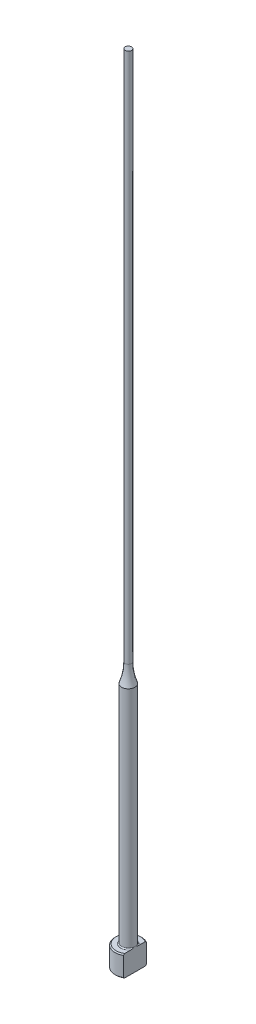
from build123d import *
from build123d.topology import SkipClean

# Parameters (mm, degrees)
CHAMFER1_SIZE    = 0.2
FILLET1_R        = 0.2
KEYED_HEAD_DEPTH = 151.041660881


with BuildPart() as part:
    # Sketch1 → Revolve1 (revolve)
    with BuildSketch(Plane.XY, mode=Mode.PRIVATE) as revolve1_sk:
        with BuildLine():
            Line((0, 0), (-2.5, 0))
            Line((-2.5, 0), (-2.5, 4))
            Line((-2.5, 4), (-1.25, 4))
            Line((-1.25, 4), (-1.25, 46.453522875))
            ThreePointArc((-1.25, 46.453522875), (-0.763842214, 48.197224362), (-0.6, 50))
            Line((-0.6, 50), (-0.6, 150))
            Line((-0.6, 150), (0, 150))
            Line((0, 150), (0, 0))
        make_face()
    revolve(revolve1_sk.sketch.rotate(Axis((0, 259.958771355, 0), (0, -1, 0)), 270), axis=Axis((0, 259.958771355, 0), (0, -1, 0)))

    # Chamfer1
    chamfer1_edges = [part.edges().sort_by_distance(p)[0] for p in [
        (0, 0, -2.5),
        (0, 4, -2.5),
    ]]
    chamfer(chamfer1_edges, length=CHAMFER1_SIZE)

    # Fillet1
    fillet1_edges = [part.edges().sort_by_distance(p)[0] for p in [
        (0, 4, -1.25),
    ]]
    fillet(fillet1_edges, radius=FILLET1_R)

    # Sketch2 → Keyed Head (cut, through all)
    with SkipClean():  # the faces are left unmerged after this step: merging them gives an invalid solid
        with BuildSketch(Plane(origin=(0, 0, 0), x_dir=(1, 0, 0), z_dir=(0, 1, 0))):
            with BuildLine():
                Line((1.25, -2.165063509), (1.25, 2.165063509))
                ThreePointArc((1.25, 2.165063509), (2.5, 0), (1.25, -2.165063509))
            make_face()
        extrude(amount=KEYED_HEAD_DEPTH, mode=Mode.SUBTRACT)


solid = part.part
